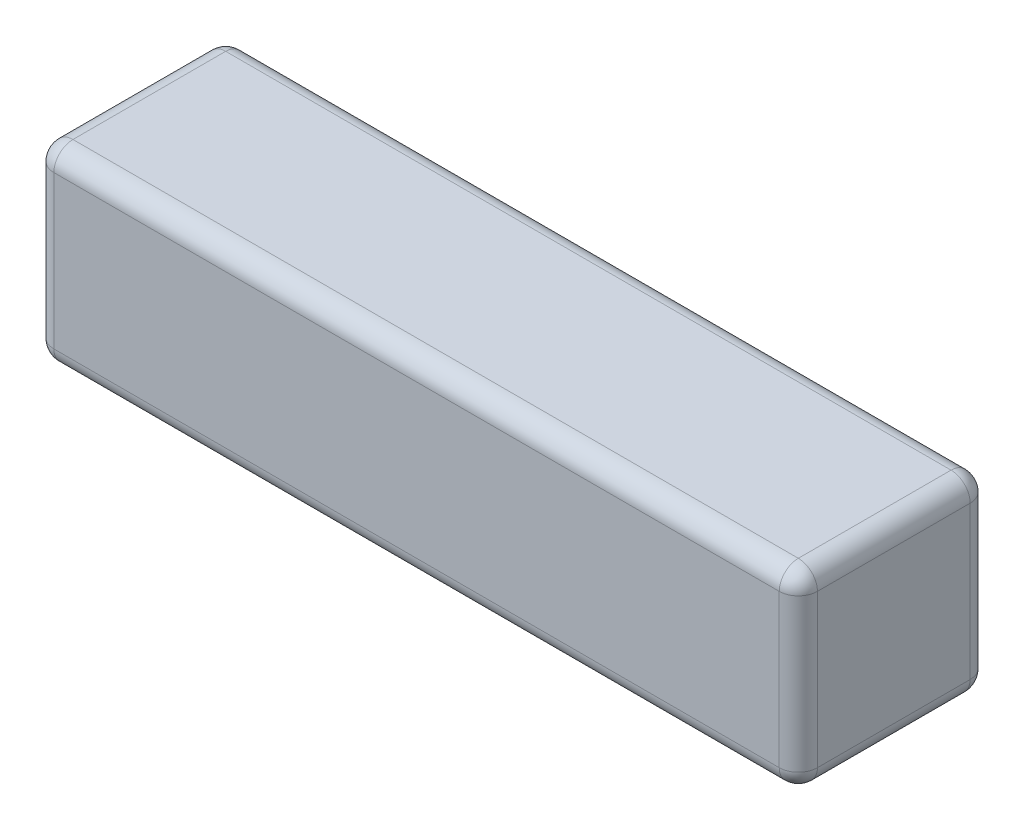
ISO-10303-21;
HEADER;
FILE_DESCRIPTION(('STEP AP214'),'2;1');
FILE_NAME('part.step','',(''),(''),'','','');
FILE_SCHEMA(('AUTOMOTIVE_DESIGN { 1 0 10303 214 1 1 1 1 }'));
ENDSEC;
DATA;
#1=APPLICATION_CONTEXT('core data for automotive mechanical design processes');
#2=APPLICATION_PROTOCOL_DEFINITION('international standard','automotive_design',2000,#1);
#3=PRODUCT_CONTEXT('',#1,'mechanical');
#4=PRODUCT('Part','Part','',(#3));
#5=PRODUCT_RELATED_PRODUCT_CATEGORY('part','',(#4));
#6=PRODUCT_DEFINITION_FORMATION('','',#4);
#7=PRODUCT_DEFINITION_CONTEXT('part definition',#1,'design');
#8=PRODUCT_DEFINITION('design','',#6,#7);
#9=PRODUCT_DEFINITION_SHAPE('','',#8);
#10=(LENGTH_UNIT() NAMED_UNIT(*) SI_UNIT(.MILLI.,.METRE.));
#11=(NAMED_UNIT(*) PLANE_ANGLE_UNIT() SI_UNIT($,.RADIAN.));
#12=(NAMED_UNIT(*) SI_UNIT($,.STERADIAN.) SOLID_ANGLE_UNIT());
#13=UNCERTAINTY_MEASURE_WITH_UNIT(LENGTH_MEASURE(1.E-05),#10,'distance_accuracy_value','');
#14=(GEOMETRIC_REPRESENTATION_CONTEXT(3) GLOBAL_UNCERTAINTY_ASSIGNED_CONTEXT((#13)) GLOBAL_UNIT_ASSIGNED_CONTEXT((#10,
#11,#12)) REPRESENTATION_CONTEXT('',''));
#15=CARTESIAN_POINT('',(0.,0.,0.));
#16=DIRECTION('',(0.,0.,1.));
#17=DIRECTION('',(1.,0.,0.));
#18=AXIS2_PLACEMENT_3D('',#15,#16,#17);
#19=CARTESIAN_POINT('',(-326.4,114.74031182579,100.));
#20=DIRECTION('',(1.,0.,0.));
#21=DIRECTION('',(0.,1.,0.));
#22=AXIS2_PLACEMENT_3D('',#19,#20,#21);
#23=PLANE('',#22);
#24=DIRECTION('',(0.,-1.,0.));
#25=VECTOR('',#24,1.);
#26=CARTESIAN_POINT('',(-326.4,114.74031182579,9.99999999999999));
#27=LINE('',#26,#25);
#28=CARTESIAN_POINT('',(-326.4,104.74031182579,9.99999999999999));
#29=VERTEX_POINT('',#28);
#30=CARTESIAN_POINT('',(-326.4,24.7403118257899,9.99999999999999));
#31=VERTEX_POINT('',#30);
#32=EDGE_CURVE('E285',#29,#31,#27,.T.);
#33=ORIENTED_EDGE('',*,*,#32,.T.);
#34=DIRECTION('',(0.,0.,-1.));
#35=VECTOR('',#34,1.);
#36=CARTESIAN_POINT('',(-326.4,24.7403118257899,100.));
#37=LINE('',#36,#35);
#38=CARTESIAN_POINT('',(-326.4,24.7403118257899,90.));
#39=VERTEX_POINT('',#38);
#40=EDGE_CURVE('E224',#31,#39,#37,.F.);
#41=ORIENTED_EDGE('',*,*,#40,.T.);
#42=DIRECTION('',(0.,-1.,0.));
#43=VECTOR('',#42,1.);
#44=CARTESIAN_POINT('',(-326.4,114.74031182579,90.));
#45=LINE('',#44,#43);
#46=CARTESIAN_POINT('',(-326.4,104.74031182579,90.));
#47=VERTEX_POINT('',#46);
#48=EDGE_CURVE('E214',#39,#47,#45,.F.);
#49=ORIENTED_EDGE('',*,*,#48,.T.);
#50=DIRECTION('',(0.,0.,-1.));
#51=VECTOR('',#50,1.);
#52=CARTESIAN_POINT('',(-326.4,104.74031182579,100.));
#53=LINE('',#52,#51);
#54=EDGE_CURVE('E282',#47,#29,#53,.T.);
#55=ORIENTED_EDGE('',*,*,#54,.T.);
#56=EDGE_LOOP('',(#33,#41,#49,#55));
#57=FACE_BOUND('',#56,.T.);
#58=ADVANCED_FACE('F37',(#57),#23,.F.);
#59=CARTESIAN_POINT('',(-26.4,14.7403118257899,100.));
#60=DIRECTION('',(0.,1.,0.));
#61=DIRECTION('',(-1.,0.,0.));
#62=AXIS2_PLACEMENT_3D('',#59,#60,#61);
#63=PLANE('',#62);
#64=DIRECTION('',(1.,0.,0.));
#65=VECTOR('',#64,1.);
#66=CARTESIAN_POINT('',(-26.4,14.7403118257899,9.99999999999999));
#67=LINE('',#66,#65);
#68=CARTESIAN_POINT('',(-316.4,14.7403118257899,9.99999999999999));
#69=VERTEX_POINT('',#68);
#70=CARTESIAN_POINT('',(63.6,14.7403118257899,9.99999999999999));
#71=VERTEX_POINT('',#70);
#72=EDGE_CURVE('E266',#69,#71,#67,.T.);
#73=ORIENTED_EDGE('',*,*,#72,.T.);
#74=DIRECTION('',(0.,0.,-1.));
#75=VECTOR('',#74,1.);
#76=CARTESIAN_POINT('',(63.6,14.7403118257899,100.));
#77=LINE('',#76,#75);
#78=CARTESIAN_POINT('',(63.6,14.7403118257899,90.));
#79=VERTEX_POINT('',#78);
#80=EDGE_CURVE('E263',#71,#79,#77,.F.);
#81=ORIENTED_EDGE('',*,*,#80,.T.);
#82=DIRECTION('',(1.,0.,0.));
#83=VECTOR('',#82,1.);
#84=CARTESIAN_POINT('',(-326.4,14.7403118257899,90.));
#85=LINE('',#84,#83);
#86=CARTESIAN_POINT('',(-316.4,14.7403118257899,90.));
#87=VERTEX_POINT('',#86);
#88=EDGE_CURVE('E255',#79,#87,#85,.F.);
#89=ORIENTED_EDGE('',*,*,#88,.T.);
#90=DIRECTION('',(0.,0.,-1.));
#91=VECTOR('',#90,1.);
#92=CARTESIAN_POINT('',(-316.4,14.7403118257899,100.));
#93=LINE('',#92,#91);
#94=EDGE_CURVE('E260',#87,#69,#93,.T.);
#95=ORIENTED_EDGE('',*,*,#94,.T.);
#96=EDGE_LOOP('',(#73,#81,#89,#95));
#97=FACE_BOUND('',#96,.T.);
#98=ADVANCED_FACE('F264',(#97),#63,.F.);
#99=CARTESIAN_POINT('',(73.6,114.74031182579,100.));
#100=DIRECTION('',(-1.,0.,0.));
#101=DIRECTION('',(0.,-1.,0.));
#102=AXIS2_PLACEMENT_3D('',#99,#100,#101);
#103=PLANE('',#102);
#104=DIRECTION('',(0.,1.,0.));
#105=VECTOR('',#104,1.);
#106=CARTESIAN_POINT('',(73.6,14.7403118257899,90.));
#107=LINE('',#106,#105);
#108=CARTESIAN_POINT('',(73.6,104.74031182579,90.));
#109=VERTEX_POINT('',#108);
#110=CARTESIAN_POINT('',(73.6,24.7403118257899,90.));
#111=VERTEX_POINT('',#110);
#112=EDGE_CURVE('E136',#109,#111,#107,.F.);
#113=ORIENTED_EDGE('',*,*,#112,.T.);
#114=DIRECTION('',(0.,0.,-1.));
#115=VECTOR('',#114,1.);
#116=CARTESIAN_POINT('',(73.6,24.7403118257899,100.));
#117=LINE('',#116,#115);
#118=CARTESIAN_POINT('',(73.6,24.7403118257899,9.99999999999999));
#119=VERTEX_POINT('',#118);
#120=EDGE_CURVE('E132',#111,#119,#117,.T.);
#121=ORIENTED_EDGE('',*,*,#120,.T.);
#122=DIRECTION('',(0.,1.,0.));
#123=VECTOR('',#122,1.);
#124=CARTESIAN_POINT('',(73.6,114.74031182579,9.99999999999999));
#125=LINE('',#124,#123);
#126=CARTESIAN_POINT('',(73.6,104.74031182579,9.99999999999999));
#127=VERTEX_POINT('',#126);
#128=EDGE_CURVE('E126',#119,#127,#125,.T.);
#129=ORIENTED_EDGE('',*,*,#128,.T.);
#130=DIRECTION('',(0.,0.,-1.));
#131=VECTOR('',#130,1.);
#132=CARTESIAN_POINT('',(73.6,104.74031182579,100.));
#133=LINE('',#132,#131);
#134=EDGE_CURVE('E129',#127,#109,#133,.F.);
#135=ORIENTED_EDGE('',*,*,#134,.T.);
#136=EDGE_LOOP('',(#113,#121,#129,#135));
#137=FACE_BOUND('',#136,.T.);
#138=ADVANCED_FACE('F128',(#137),#103,.F.);
#139=CARTESIAN_POINT('',(-326.4,114.74031182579,100.));
#140=DIRECTION('',(0.,-1.,0.));
#141=DIRECTION('',(0.,0.,-1.));
#142=AXIS2_PLACEMENT_3D('',#139,#140,#141);
#143=PLANE('',#142);
#144=DIRECTION('',(-1.,0.,0.));
#145=VECTOR('',#144,1.);
#146=CARTESIAN_POINT('',(73.6,114.74031182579,90.));
#147=LINE('',#146,#145);
#148=CARTESIAN_POINT('',(-316.4,114.74031182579,90.));
#149=VERTEX_POINT('',#148);
#150=CARTESIAN_POINT('',(63.6,114.74031182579,90.));
#151=VERTEX_POINT('',#150);
#152=EDGE_CURVE('E46',#149,#151,#147,.F.);
#153=ORIENTED_EDGE('',*,*,#152,.T.);
#154=DIRECTION('',(0.,0.,-1.));
#155=VECTOR('',#154,1.);
#156=CARTESIAN_POINT('',(63.6,114.74031182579,100.));
#157=LINE('',#156,#155);
#158=CARTESIAN_POINT('',(63.6,114.74031182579,9.99999999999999));
#159=VERTEX_POINT('',#158);
#160=EDGE_CURVE('E11',#151,#159,#157,.T.);
#161=ORIENTED_EDGE('',*,*,#160,.T.);
#162=DIRECTION('',(-1.,0.,0.));
#163=VECTOR('',#162,1.);
#164=CARTESIAN_POINT('',(-326.4,114.74031182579,9.99999999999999));
#165=LINE('',#164,#163);
#166=CARTESIAN_POINT('',(-316.4,114.74031182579,9.99999999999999));
#167=VERTEX_POINT('',#166);
#168=EDGE_CURVE('E230',#159,#167,#165,.T.);
#169=ORIENTED_EDGE('',*,*,#168,.T.);
#170=DIRECTION('',(0.,0.,-1.));
#171=VECTOR('',#170,1.);
#172=CARTESIAN_POINT('',(-316.4,114.74031182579,100.));
#173=LINE('',#172,#171);
#174=EDGE_CURVE('E57',#167,#149,#173,.F.);
#175=ORIENTED_EDGE('',*,*,#174,.T.);
#176=EDGE_LOOP('',(#153,#161,#169,#175));
#177=FACE_BOUND('',#176,.T.);
#178=ADVANCED_FACE('F387',(#177),#143,.F.);
#179=CARTESIAN_POINT('',(0.,0.,100.));
#180=DIRECTION('',(0.,0.,1.));
#181=DIRECTION('',(1.,0.,0.));
#182=AXIS2_PLACEMENT_3D('',#179,#180,#181);
#183=PLANE('',#182);
#184=DIRECTION('',(1.,0.,0.));
#185=VECTOR('',#184,1.);
#186=CARTESIAN_POINT('',(73.6,24.7403118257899,100.));
#187=LINE('',#186,#185);
#188=CARTESIAN_POINT('',(-316.4,24.7403118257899,100.));
#189=VERTEX_POINT('',#188);
#190=CARTESIAN_POINT('',(63.6,24.7403118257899,100.));
#191=VERTEX_POINT('',#190);
#192=EDGE_CURVE('E219',#189,#191,#187,.T.);
#193=ORIENTED_EDGE('',*,*,#192,.T.);
#194=DIRECTION('',(0.,1.,0.));
#195=VECTOR('',#194,1.);
#196=CARTESIAN_POINT('',(63.6,114.74031182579,100.));
#197=LINE('',#196,#195);
#198=CARTESIAN_POINT('',(63.6,104.74031182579,100.));
#199=VERTEX_POINT('',#198);
#200=EDGE_CURVE('E222',#191,#199,#197,.T.);
#201=ORIENTED_EDGE('',*,*,#200,.T.);
#202=DIRECTION('',(-1.,0.,0.));
#203=VECTOR('',#202,1.);
#204=CARTESIAN_POINT('',(-326.4,104.74031182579,100.));
#205=LINE('',#204,#203);
#206=CARTESIAN_POINT('',(-316.4,104.74031182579,100.));
#207=VERTEX_POINT('',#206);
#208=EDGE_CURVE('E220',#199,#207,#205,.T.);
#209=ORIENTED_EDGE('',*,*,#208,.T.);
#210=DIRECTION('',(0.,-1.,0.));
#211=VECTOR('',#210,1.);
#212=CARTESIAN_POINT('',(-316.4,14.7403118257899,100.));
#213=LINE('',#212,#211);
#214=EDGE_CURVE('E216',#207,#189,#213,.T.);
#215=ORIENTED_EDGE('',*,*,#214,.T.);
#216=EDGE_LOOP('',(#193,#201,#209,#215));
#217=FACE_BOUND('',#216,.T.);
#218=ADVANCED_FACE('F311',(#217),#183,.T.);
#219=CARTESIAN_POINT('',(0.,0.,0.));
#220=DIRECTION('',(0.,0.,1.));
#221=DIRECTION('',(1.,0.,0.));
#222=AXIS2_PLACEMENT_3D('',#219,#220,#221);
#223=PLANE('',#222);
#224=DIRECTION('',(0.,1.,0.));
#225=VECTOR('',#224,1.);
#226=CARTESIAN_POINT('',(63.6,0.,0.));
#227=LINE('',#226,#225);
#228=CARTESIAN_POINT('',(63.6,104.74031182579,0.));
#229=VERTEX_POINT('',#228);
#230=CARTESIAN_POINT('',(63.6,24.7403118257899,0.));
#231=VERTEX_POINT('',#230);
#232=EDGE_CURVE('E157',#229,#231,#227,.F.);
#233=ORIENTED_EDGE('',*,*,#232,.T.);
#234=DIRECTION('',(1.,0.,0.));
#235=VECTOR('',#234,1.);
#236=CARTESIAN_POINT('',(0.,24.7403118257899,0.));
#237=LINE('',#236,#235);
#238=CARTESIAN_POINT('',(-316.4,24.7403118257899,0.));
#239=VERTEX_POINT('',#238);
#240=EDGE_CURVE('E279',#231,#239,#237,.F.);
#241=ORIENTED_EDGE('',*,*,#240,.T.);
#242=DIRECTION('',(0.,-1.,0.));
#243=VECTOR('',#242,1.);
#244=CARTESIAN_POINT('',(-316.4,-3.51274564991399E-13,0.));
#245=LINE('',#244,#243);
#246=CARTESIAN_POINT('',(-316.4,104.74031182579,0.));
#247=VERTEX_POINT('',#246);
#248=EDGE_CURVE('E272',#239,#247,#245,.F.);
#249=ORIENTED_EDGE('',*,*,#248,.T.);
#250=DIRECTION('',(-1.,0.,0.));
#251=VECTOR('',#250,1.);
#252=CARTESIAN_POINT('',(0.,104.74031182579,0.));
#253=LINE('',#252,#251);
#254=EDGE_CURVE('E270',#247,#229,#253,.F.);
#255=ORIENTED_EDGE('',*,*,#254,.T.);
#256=EDGE_LOOP('',(#233,#241,#249,#255));
#257=FACE_BOUND('',#256,.T.);
#258=ADVANCED_FACE('F378',(#257),#223,.F.);
#259=CARTESIAN_POINT('',(-316.4,104.74031182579,100.));
#260=DIRECTION('',(0.,0.,-1.));
#261=DIRECTION('',(-1.,0.,0.));
#262=AXIS2_PLACEMENT_3D('',#259,#260,#261);
#263=CYLINDRICAL_SURFACE('',#262,10.);
#264=CARTESIAN_POINT('',(-316.4,104.74031182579,90.));
#265=DIRECTION('',(0.,0.,1.));
#266=DIRECTION('',(1.,0.,0.));
#267=AXIS2_PLACEMENT_3D('',#264,#265,#266);
#268=CIRCLE('',#267,10.);
#269=EDGE_CURVE('E41',#149,#47,#268,.T.);
#270=ORIENTED_EDGE('',*,*,#269,.F.);
#271=ORIENTED_EDGE('',*,*,#174,.F.);
#272=CARTESIAN_POINT('',(-316.4,104.74031182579,9.99999999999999));
#273=DIRECTION('',(0.,0.,-1.));
#274=DIRECTION('',(-1.,0.,0.));
#275=AXIS2_PLACEMENT_3D('',#272,#273,#274);
#276=CIRCLE('',#275,10.);
#277=EDGE_CURVE('E196',#29,#167,#276,.T.);
#278=ORIENTED_EDGE('',*,*,#277,.F.);
#279=ORIENTED_EDGE('',*,*,#54,.F.);
#280=EDGE_LOOP('',(#270,#271,#278,#279));
#281=FACE_BOUND('',#280,.T.);
#282=ADVANCED_FACE('F39',(#281),#263,.T.);
#283=CARTESIAN_POINT('',(-316.4,104.74031182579,90.));
#284=DIRECTION('',(0.,0.,1.));
#285=DIRECTION('',(1.,0.,0.));
#286=AXIS2_PLACEMENT_3D('',#283,#284,#285);
#287=SPHERICAL_SURFACE('',#286,10.);
#288=CARTESIAN_POINT('',(-316.4,104.74031182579,90.));
#289=DIRECTION('',(-1.,0.,0.));
#290=DIRECTION('',(0.,0.,1.));
#291=AXIS2_PLACEMENT_3D('',#288,#289,#290);
#292=CIRCLE('',#291,10.);
#293=EDGE_CURVE('E191',#149,#207,#292,.F.);
#294=ORIENTED_EDGE('',*,*,#293,.F.);
#295=ORIENTED_EDGE('',*,*,#269,.T.);
#296=CARTESIAN_POINT('',(-316.4,104.74031182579,90.));
#297=DIRECTION('',(0.,1.,0.));
#298=DIRECTION('',(-1.,0.,0.));
#299=AXIS2_PLACEMENT_3D('',#296,#297,#298);
#300=CIRCLE('',#299,10.);
#301=EDGE_CURVE('E194',#207,#47,#300,.F.);
#302=ORIENTED_EDGE('',*,*,#301,.F.);
#303=EDGE_LOOP('',(#294,#295,#302));
#304=FACE_BOUND('',#303,.T.);
#305=ADVANCED_FACE('F206',(#304),#287,.T.);
#306=CARTESIAN_POINT('',(-316.4,104.74031182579,10.));
#307=DIRECTION('',(0.,0.,1.));
#308=DIRECTION('',(1.,0.,0.));
#309=AXIS2_PLACEMENT_3D('',#306,#307,#308);
#310=SPHERICAL_SURFACE('',#309,10.);
#311=CARTESIAN_POINT('',(-316.4,104.74031182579,10.));
#312=DIRECTION('',(0.,1.,0.));
#313=DIRECTION('',(-1.,0.,0.));
#314=AXIS2_PLACEMENT_3D('',#311,#312,#313);
#315=CIRCLE('',#314,10.);
#316=EDGE_CURVE('E185',#29,#247,#315,.F.);
#317=ORIENTED_EDGE('',*,*,#316,.F.);
#318=ORIENTED_EDGE('',*,*,#277,.T.);
#319=CARTESIAN_POINT('',(-316.4,104.74031182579,9.99999999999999));
#320=DIRECTION('',(-1.,0.,0.));
#321=DIRECTION('',(0.,0.,1.));
#322=AXIS2_PLACEMENT_3D('',#319,#320,#321);
#323=CIRCLE('',#322,10.);
#324=EDGE_CURVE('E188',#247,#167,#323,.F.);
#325=ORIENTED_EDGE('',*,*,#324,.F.);
#326=EDGE_LOOP('',(#317,#318,#325));
#327=FACE_BOUND('',#326,.T.);
#328=ADVANCED_FACE('F329',(#327),#310,.T.);
#329=CARTESIAN_POINT('',(-316.4,-3.51274564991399E-13,90.));
#330=DIRECTION('',(0.,1.,0.));
#331=DIRECTION('',(-1.,0.,0.));
#332=AXIS2_PLACEMENT_3D('',#329,#330,#331);
#333=CYLINDRICAL_SURFACE('',#332,10.);
#334=ORIENTED_EDGE('',*,*,#301,.T.);
#335=ORIENTED_EDGE('',*,*,#48,.F.);
#336=CARTESIAN_POINT('',(-316.4,24.7403118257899,90.));
#337=DIRECTION('',(0.,-1.,0.));
#338=DIRECTION('',(1.,0.,0.));
#339=AXIS2_PLACEMENT_3D('',#336,#337,#338);
#340=CIRCLE('',#339,10.);
#341=EDGE_CURVE('E180',#189,#39,#340,.T.);
#342=ORIENTED_EDGE('',*,*,#341,.F.);
#343=ORIENTED_EDGE('',*,*,#214,.F.);
#344=EDGE_LOOP('',(#334,#335,#342,#343));
#345=FACE_BOUND('',#344,.T.);
#346=ADVANCED_FACE('F212',(#345),#333,.T.);
#347=CARTESIAN_POINT('',(0.,104.74031182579,90.));
#348=DIRECTION('',(1.,0.,0.));
#349=DIRECTION('',(0.,0.,-1.));
#350=AXIS2_PLACEMENT_3D('',#347,#348,#349);
#351=CYLINDRICAL_SURFACE('',#350,10.);
#352=ORIENTED_EDGE('',*,*,#293,.T.);
#353=ORIENTED_EDGE('',*,*,#208,.F.);
#354=CARTESIAN_POINT('',(63.6,104.74031182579,90.));
#355=DIRECTION('',(1.,0.,0.));
#356=DIRECTION('',(0.,0.,-1.));
#357=AXIS2_PLACEMENT_3D('',#354,#355,#356);
#358=CIRCLE('',#357,10.);
#359=EDGE_CURVE('E177',#151,#199,#358,.T.);
#360=ORIENTED_EDGE('',*,*,#359,.F.);
#361=ORIENTED_EDGE('',*,*,#152,.F.);
#362=EDGE_LOOP('',(#352,#353,#360,#361));
#363=FACE_BOUND('',#362,.T.);
#364=ADVANCED_FACE('F320',(#363),#351,.T.);
#365=CARTESIAN_POINT('',(63.6,104.74031182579,100.));
#366=DIRECTION('',(0.,0.,-1.));
#367=DIRECTION('',(-1.,0.,0.));
#368=AXIS2_PLACEMENT_3D('',#365,#366,#367);
#369=CYLINDRICAL_SURFACE('',#368,10.);
#370=CARTESIAN_POINT('',(63.6,104.74031182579,9.99999999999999));
#371=DIRECTION('',(0.,0.,-1.));
#372=DIRECTION('',(-1.,0.,0.));
#373=AXIS2_PLACEMENT_3D('',#370,#371,#372);
#374=CIRCLE('',#373,10.);
#375=EDGE_CURVE('E142',#159,#127,#374,.T.);
#376=ORIENTED_EDGE('',*,*,#375,.F.);
#377=ORIENTED_EDGE('',*,*,#160,.F.);
#378=CARTESIAN_POINT('',(63.6,104.74031182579,90.));
#379=DIRECTION('',(0.,0.,1.));
#380=DIRECTION('',(1.,0.,0.));
#381=AXIS2_PLACEMENT_3D('',#378,#379,#380);
#382=CIRCLE('',#381,10.);
#383=EDGE_CURVE('E145',#109,#151,#382,.T.);
#384=ORIENTED_EDGE('',*,*,#383,.F.);
#385=ORIENTED_EDGE('',*,*,#134,.F.);
#386=EDGE_LOOP('',(#376,#377,#384,#385));
#387=FACE_BOUND('',#386,.T.);
#388=ADVANCED_FACE('F141',(#387),#369,.T.);
#389=CARTESIAN_POINT('',(-326.4,104.74031182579,9.99999999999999));
#390=DIRECTION('',(-1.,0.,0.));
#391=DIRECTION('',(0.,0.,1.));
#392=AXIS2_PLACEMENT_3D('',#389,#390,#391);
#393=CYLINDRICAL_SURFACE('',#392,10.);
#394=ORIENTED_EDGE('',*,*,#324,.T.);
#395=ORIENTED_EDGE('',*,*,#168,.F.);
#396=CARTESIAN_POINT('',(63.6,104.74031182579,10.));
#397=DIRECTION('',(1.,0.,0.));
#398=DIRECTION('',(0.,1.,0.));
#399=AXIS2_PLACEMENT_3D('',#396,#397,#398);
#400=CIRCLE('',#399,10.);
#401=EDGE_CURVE('E154',#229,#159,#400,.T.);
#402=ORIENTED_EDGE('',*,*,#401,.F.);
#403=ORIENTED_EDGE('',*,*,#254,.F.);
#404=EDGE_LOOP('',(#394,#395,#402,#403));
#405=FACE_BOUND('',#404,.T.);
#406=ADVANCED_FACE('F327',(#405),#393,.T.);
#407=CARTESIAN_POINT('',(-316.4,114.74031182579,9.99999999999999));
#408=DIRECTION('',(0.,-1.,0.));
#409=DIRECTION('',(1.,0.,0.));
#410=AXIS2_PLACEMENT_3D('',#407,#408,#409);
#411=CYLINDRICAL_SURFACE('',#410,10.);
#412=ORIENTED_EDGE('',*,*,#316,.T.);
#413=ORIENTED_EDGE('',*,*,#248,.F.);
#414=CARTESIAN_POINT('',(-316.4,24.7403118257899,9.99999999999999));
#415=DIRECTION('',(0.,-1.,0.));
#416=DIRECTION('',(1.,0.,0.));
#417=AXIS2_PLACEMENT_3D('',#414,#415,#416);
#418=CIRCLE('',#417,10.);
#419=EDGE_CURVE('E172',#31,#239,#418,.T.);
#420=ORIENTED_EDGE('',*,*,#419,.F.);
#421=ORIENTED_EDGE('',*,*,#32,.F.);
#422=EDGE_LOOP('',(#412,#413,#420,#421));
#423=FACE_BOUND('',#422,.T.);
#424=ADVANCED_FACE('F297',(#423),#411,.T.);
#425=CARTESIAN_POINT('',(-316.4,24.7403118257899,100.));
#426=DIRECTION('',(0.,0.,-1.));
#427=DIRECTION('',(-1.,0.,0.));
#428=AXIS2_PLACEMENT_3D('',#425,#426,#427);
#429=CYLINDRICAL_SURFACE('',#428,10.);
#430=CARTESIAN_POINT('',(-316.4,24.7403118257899,90.));
#431=DIRECTION('',(0.,0.,1.));
#432=DIRECTION('',(1.,0.,0.));
#433=AXIS2_PLACEMENT_3D('',#430,#431,#432);
#434=CIRCLE('',#433,10.);
#435=EDGE_CURVE('E182',#39,#87,#434,.T.);
#436=ORIENTED_EDGE('',*,*,#435,.F.);
#437=ORIENTED_EDGE('',*,*,#40,.F.);
#438=CARTESIAN_POINT('',(-316.4,24.7403118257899,9.99999999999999));
#439=DIRECTION('',(0.,0.,-1.));
#440=DIRECTION('',(-1.,0.,0.));
#441=AXIS2_PLACEMENT_3D('',#438,#439,#440);
#442=CIRCLE('',#441,10.);
#443=EDGE_CURVE('E169',#69,#31,#442,.T.);
#444=ORIENTED_EDGE('',*,*,#443,.F.);
#445=ORIENTED_EDGE('',*,*,#94,.F.);
#446=EDGE_LOOP('',(#436,#437,#444,#445));
#447=FACE_BOUND('',#446,.T.);
#448=ADVANCED_FACE('F293',(#447),#429,.T.);
#449=CARTESIAN_POINT('',(-316.4,24.7403118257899,90.));
#450=DIRECTION('',(0.,0.,1.));
#451=DIRECTION('',(1.,0.,0.));
#452=AXIS2_PLACEMENT_3D('',#449,#450,#451);
#453=SPHERICAL_SURFACE('',#452,10.);
#454=ORIENTED_EDGE('',*,*,#341,.T.);
#455=ORIENTED_EDGE('',*,*,#435,.T.);
#456=CARTESIAN_POINT('',(-316.4,24.7403118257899,90.));
#457=DIRECTION('',(-1.,0.,0.));
#458=DIRECTION('',(0.,0.,1.));
#459=AXIS2_PLACEMENT_3D('',#456,#457,#458);
#460=CIRCLE('',#459,10.);
#461=EDGE_CURVE('E161',#189,#87,#460,.F.);
#462=ORIENTED_EDGE('',*,*,#461,.F.);
#463=EDGE_LOOP('',(#454,#455,#462));
#464=FACE_BOUND('',#463,.T.);
#465=ADVANCED_FACE('F309',(#464),#453,.T.);
#466=CARTESIAN_POINT('',(63.6,104.74031182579,90.));
#467=DIRECTION('',(0.,0.,1.));
#468=DIRECTION('',(1.,0.,0.));
#469=AXIS2_PLACEMENT_3D('',#466,#467,#468);
#470=SPHERICAL_SURFACE('',#469,10.);
#471=ORIENTED_EDGE('',*,*,#383,.T.);
#472=ORIENTED_EDGE('',*,*,#359,.T.);
#473=CARTESIAN_POINT('',(63.6,104.74031182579,90.));
#474=DIRECTION('',(0.,1.,0.));
#475=DIRECTION('',(0.,0.,1.));
#476=AXIS2_PLACEMENT_3D('',#473,#474,#475);
#477=CIRCLE('',#476,10.);
#478=EDGE_CURVE('E158',#109,#199,#477,.F.);
#479=ORIENTED_EDGE('',*,*,#478,.F.);
#480=EDGE_LOOP('',(#471,#472,#479));
#481=FACE_BOUND('',#480,.T.);
#482=ADVANCED_FACE('F318',(#481),#470,.T.);
#483=CARTESIAN_POINT('',(63.6,104.74031182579,10.));
#484=DIRECTION('',(0.,0.,1.));
#485=DIRECTION('',(1.,0.,0.));
#486=AXIS2_PLACEMENT_3D('',#483,#484,#485);
#487=SPHERICAL_SURFACE('',#486,10.);
#488=ORIENTED_EDGE('',*,*,#401,.T.);
#489=ORIENTED_EDGE('',*,*,#375,.T.);
#490=CARTESIAN_POINT('',(63.6,104.74031182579,9.99999999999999));
#491=DIRECTION('',(0.,1.,0.));
#492=DIRECTION('',(0.,0.,1.));
#493=AXIS2_PLACEMENT_3D('',#490,#491,#492);
#494=CIRCLE('',#493,10.);
#495=EDGE_CURVE('E151',#229,#127,#494,.F.);
#496=ORIENTED_EDGE('',*,*,#495,.F.);
#497=EDGE_LOOP('',(#488,#489,#496));
#498=FACE_BOUND('',#497,.T.);
#499=ADVANCED_FACE('F150',(#498),#487,.T.);
#500=CARTESIAN_POINT('',(-316.4,24.7403118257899,10.));
#501=DIRECTION('',(0.,0.,1.));
#502=DIRECTION('',(1.,0.,0.));
#503=AXIS2_PLACEMENT_3D('',#500,#501,#502);
#504=SPHERICAL_SURFACE('',#503,10.);
#505=ORIENTED_EDGE('',*,*,#443,.T.);
#506=ORIENTED_EDGE('',*,*,#419,.T.);
#507=CARTESIAN_POINT('',(-316.4,24.7403118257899,10.));
#508=DIRECTION('',(-1.,0.,0.));
#509=DIRECTION('',(0.,0.,1.));
#510=AXIS2_PLACEMENT_3D('',#507,#508,#509);
#511=CIRCLE('',#510,10.);
#512=EDGE_CURVE('E159',#69,#239,#511,.F.);
#513=ORIENTED_EDGE('',*,*,#512,.F.);
#514=EDGE_LOOP('',(#505,#506,#513));
#515=FACE_BOUND('',#514,.T.);
#516=ADVANCED_FACE('F299',(#515),#504,.T.);
#517=CARTESIAN_POINT('',(0.,24.7403118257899,90.));
#518=DIRECTION('',(-1.,0.,0.));
#519=DIRECTION('',(0.,-1.,0.));
#520=AXIS2_PLACEMENT_3D('',#517,#518,#519);
#521=CYLINDRICAL_SURFACE('',#520,10.);
#522=ORIENTED_EDGE('',*,*,#461,.T.);
#523=ORIENTED_EDGE('',*,*,#88,.F.);
#524=CARTESIAN_POINT('',(63.6,24.7403118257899,90.));
#525=DIRECTION('',(1.,0.,0.));
#526=DIRECTION('',(0.,0.,-1.));
#527=AXIS2_PLACEMENT_3D('',#524,#525,#526);
#528=CIRCLE('',#527,10.);
#529=EDGE_CURVE('E163',#191,#79,#528,.T.);
#530=ORIENTED_EDGE('',*,*,#529,.F.);
#531=ORIENTED_EDGE('',*,*,#192,.F.);
#532=EDGE_LOOP('',(#522,#523,#530,#531));
#533=FACE_BOUND('',#532,.T.);
#534=ADVANCED_FACE('F257',(#533),#521,.T.);
#535=CARTESIAN_POINT('',(63.6,0.,90.));
#536=DIRECTION('',(0.,-1.,0.));
#537=DIRECTION('',(1.,0.,0.));
#538=AXIS2_PLACEMENT_3D('',#535,#536,#537);
#539=CYLINDRICAL_SURFACE('',#538,10.);
#540=ORIENTED_EDGE('',*,*,#478,.T.);
#541=ORIENTED_EDGE('',*,*,#200,.F.);
#542=CARTESIAN_POINT('',(63.6,24.7403118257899,90.));
#543=DIRECTION('',(0.,-1.,0.));
#544=DIRECTION('',(0.,0.,-1.));
#545=AXIS2_PLACEMENT_3D('',#542,#543,#544);
#546=CIRCLE('',#545,10.);
#547=EDGE_CURVE('E244',#111,#191,#546,.T.);
#548=ORIENTED_EDGE('',*,*,#547,.F.);
#549=ORIENTED_EDGE('',*,*,#112,.F.);
#550=EDGE_LOOP('',(#540,#541,#548,#549));
#551=FACE_BOUND('',#550,.T.);
#552=ADVANCED_FACE('F313',(#551),#539,.T.);
#553=CARTESIAN_POINT('',(63.6,114.74031182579,9.99999999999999));
#554=DIRECTION('',(0.,1.,0.));
#555=DIRECTION('',(-1.,0.,0.));
#556=AXIS2_PLACEMENT_3D('',#553,#554,#555);
#557=CYLINDRICAL_SURFACE('',#556,10.);
#558=ORIENTED_EDGE('',*,*,#495,.T.);
#559=ORIENTED_EDGE('',*,*,#128,.F.);
#560=CARTESIAN_POINT('',(63.6,24.7403118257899,10.));
#561=DIRECTION('',(0.,-1.,0.));
#562=DIRECTION('',(1.,0.,0.));
#563=AXIS2_PLACEMENT_3D('',#560,#561,#562);
#564=CIRCLE('',#563,10.);
#565=EDGE_CURVE('E241',#231,#119,#564,.T.);
#566=ORIENTED_EDGE('',*,*,#565,.F.);
#567=ORIENTED_EDGE('',*,*,#232,.F.);
#568=EDGE_LOOP('',(#558,#559,#566,#567));
#569=FACE_BOUND('',#568,.T.);
#570=ADVANCED_FACE('F156',(#569),#557,.T.);
#571=CARTESIAN_POINT('',(-26.4,24.7403118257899,9.99999999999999));
#572=DIRECTION('',(1.,0.,0.));
#573=DIRECTION('',(0.,1.,0.));
#574=AXIS2_PLACEMENT_3D('',#571,#572,#573);
#575=CYLINDRICAL_SURFACE('',#574,10.);
#576=ORIENTED_EDGE('',*,*,#512,.T.);
#577=ORIENTED_EDGE('',*,*,#240,.F.);
#578=CARTESIAN_POINT('',(63.6,24.7403118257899,9.99999999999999));
#579=DIRECTION('',(1.,0.,0.));
#580=DIRECTION('',(0.,0.,-1.));
#581=AXIS2_PLACEMENT_3D('',#578,#579,#580);
#582=CIRCLE('',#581,10.);
#583=EDGE_CURVE('E238',#71,#231,#582,.T.);
#584=ORIENTED_EDGE('',*,*,#583,.F.);
#585=ORIENTED_EDGE('',*,*,#72,.F.);
#586=EDGE_LOOP('',(#576,#577,#584,#585));
#587=FACE_BOUND('',#586,.T.);
#588=ADVANCED_FACE('F302',(#587),#575,.T.);
#589=CARTESIAN_POINT('',(63.6,24.7403118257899,90.));
#590=DIRECTION('',(0.,0.,1.));
#591=DIRECTION('',(1.,0.,0.));
#592=AXIS2_PLACEMENT_3D('',#589,#590,#591);
#593=SPHERICAL_SURFACE('',#592,10.);
#594=ORIENTED_EDGE('',*,*,#547,.T.);
#595=ORIENTED_EDGE('',*,*,#529,.T.);
#596=CARTESIAN_POINT('',(63.6,24.7403118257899,90.));
#597=DIRECTION('',(0.,0.,1.));
#598=DIRECTION('',(1.,0.,0.));
#599=AXIS2_PLACEMENT_3D('',#596,#597,#598);
#600=CIRCLE('',#599,10.);
#601=EDGE_CURVE('E236',#111,#79,#600,.F.);
#602=ORIENTED_EDGE('',*,*,#601,.F.);
#603=EDGE_LOOP('',(#594,#595,#602));
#604=FACE_BOUND('',#603,.T.);
#605=ADVANCED_FACE('F251',(#604),#593,.T.);
#606=CARTESIAN_POINT('',(63.6,24.7403118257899,10.));
#607=DIRECTION('',(0.,0.,1.));
#608=DIRECTION('',(1.,0.,0.));
#609=AXIS2_PLACEMENT_3D('',#606,#607,#608);
#610=SPHERICAL_SURFACE('',#609,10.);
#611=ORIENTED_EDGE('',*,*,#583,.T.);
#612=ORIENTED_EDGE('',*,*,#565,.T.);
#613=CARTESIAN_POINT('',(63.6,24.7403118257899,9.99999999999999));
#614=DIRECTION('',(0.,0.,-1.));
#615=DIRECTION('',(-1.,0.,0.));
#616=AXIS2_PLACEMENT_3D('',#613,#614,#615);
#617=CIRCLE('',#616,10.);
#618=EDGE_CURVE('E234',#71,#119,#617,.F.);
#619=ORIENTED_EDGE('',*,*,#618,.F.);
#620=EDGE_LOOP('',(#611,#612,#619));
#621=FACE_BOUND('',#620,.T.);
#622=ADVANCED_FACE('F304',(#621),#610,.T.);
#623=CARTESIAN_POINT('',(63.6,24.7403118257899,100.));
#624=DIRECTION('',(0.,0.,-1.));
#625=DIRECTION('',(-1.,0.,0.));
#626=AXIS2_PLACEMENT_3D('',#623,#624,#625);
#627=CYLINDRICAL_SURFACE('',#626,10.);
#628=ORIENTED_EDGE('',*,*,#601,.T.);
#629=ORIENTED_EDGE('',*,*,#80,.F.);
#630=ORIENTED_EDGE('',*,*,#618,.T.);
#631=ORIENTED_EDGE('',*,*,#120,.F.);
#632=EDGE_LOOP('',(#628,#629,#630,#631));
#633=FACE_BOUND('',#632,.T.);
#634=ADVANCED_FACE('F305',(#633),#627,.T.);
#635=CLOSED_SHELL('',(#58,#98,#138,#178,#218,#258,#282,#305,#328,#346,#364,#388,#406,#424,#448,
#465,#482,#499,#516,#534,#552,#570,#588,#605,#622,#634));
#636=MANIFOLD_SOLID_BREP('B2',#635);
#637=ADVANCED_BREP_SHAPE_REPRESENTATION('',(#18,#636),#14);
#638=SHAPE_DEFINITION_REPRESENTATION(#9,#637);
ENDSEC;
END-ISO-10303-21;
